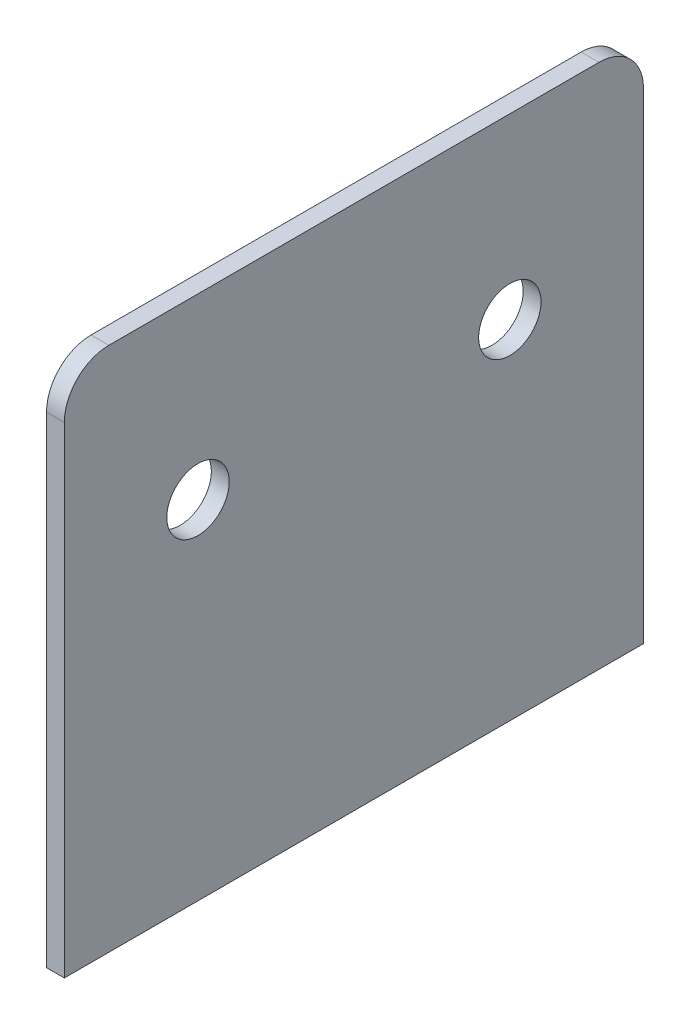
ISO-10303-21;
HEADER;
FILE_DESCRIPTION(('STEP AP214'),'2;1');
FILE_NAME('part.step','',(''),(''),'','','');
FILE_SCHEMA(('AUTOMOTIVE_DESIGN { 1 0 10303 214 1 1 1 1 }'));
ENDSEC;
DATA;
#1=APPLICATION_CONTEXT('core data for automotive mechanical design processes');
#2=APPLICATION_PROTOCOL_DEFINITION('international standard','automotive_design',2000,#1);
#3=PRODUCT_CONTEXT('',#1,'mechanical');
#4=PRODUCT('Part','Part','',(#3));
#5=PRODUCT_RELATED_PRODUCT_CATEGORY('part','',(#4));
#6=PRODUCT_DEFINITION_FORMATION('','',#4);
#7=PRODUCT_DEFINITION_CONTEXT('part definition',#1,'design');
#8=PRODUCT_DEFINITION('design','',#6,#7);
#9=PRODUCT_DEFINITION_SHAPE('','',#8);
#10=(LENGTH_UNIT() NAMED_UNIT(*) SI_UNIT(.MILLI.,.METRE.));
#11=(NAMED_UNIT(*) PLANE_ANGLE_UNIT() SI_UNIT($,.RADIAN.));
#12=(NAMED_UNIT(*) SI_UNIT($,.STERADIAN.) SOLID_ANGLE_UNIT());
#13=UNCERTAINTY_MEASURE_WITH_UNIT(LENGTH_MEASURE(1.E-05),#10,'distance_accuracy_value','');
#14=(GEOMETRIC_REPRESENTATION_CONTEXT(3) GLOBAL_UNCERTAINTY_ASSIGNED_CONTEXT((#13)) GLOBAL_UNIT_ASSIGNED_CONTEXT((#10,
#11,#12)) REPRESENTATION_CONTEXT('',''));
#15=CARTESIAN_POINT('',(0.,0.,0.));
#16=DIRECTION('',(0.,0.,1.));
#17=DIRECTION('',(1.,0.,0.));
#18=AXIS2_PLACEMENT_3D('',#15,#16,#17);
#19=CARTESIAN_POINT('',(2.,0.,32.5));
#20=DIRECTION('',(-1.,0.,0.));
#21=DIRECTION('',(0.,0.,1.));
#22=AXIS2_PLACEMENT_3D('',#19,#20,#21);
#23=PLANE('',#22);
#24=CARTESIAN_POINT('',(2.,39.,-17.5));
#25=DIRECTION('',(1.,0.,0.));
#26=DIRECTION('',(0.,0.,-1.));
#27=AXIS2_PLACEMENT_3D('',#24,#25,#26);
#28=CIRCLE('',#27,3.5);
#29=CARTESIAN_POINT('',(2.,39.,-21.));
#30=VERTEX_POINT('',#29);
#31=EDGE_CURVE('E133',#30,#30,#28,.T.);
#32=ORIENTED_EDGE('',*,*,#31,.F.);
#33=EDGE_LOOP('',(#32));
#34=FACE_BOUND('',#33,.T.);
#35=CARTESIAN_POINT('',(2.,39.,17.5));
#36=DIRECTION('',(1.,0.,0.));
#37=DIRECTION('',(0.,0.,-1.));
#38=AXIS2_PLACEMENT_3D('',#35,#36,#37);
#39=CIRCLE('',#38,3.5);
#40=CARTESIAN_POINT('',(2.,39.,14.));
#41=VERTEX_POINT('',#40);
#42=EDGE_CURVE('E129',#41,#41,#39,.T.);
#43=ORIENTED_EDGE('',*,*,#42,.F.);
#44=EDGE_LOOP('',(#43));
#45=FACE_BOUND('',#44,.T.);
#46=DIRECTION('',(0.,1.,0.));
#47=VECTOR('',#46,1.);
#48=CARTESIAN_POINT('',(2.,0.,-32.5));
#49=LINE('',#48,#47);
#50=CARTESIAN_POINT('',(2.,0.,-32.5));
#51=VERTEX_POINT('',#50);
#52=CARTESIAN_POINT('',(2.,54.,-32.5));
#53=VERTEX_POINT('',#52);
#54=EDGE_CURVE('E116',#51,#53,#49,.T.);
#55=ORIENTED_EDGE('',*,*,#54,.T.);
#56=CARTESIAN_POINT('',(2.,54.,-27.5));
#57=DIRECTION('',(-1.,0.,0.));
#58=DIRECTION('',(0.,0.,1.));
#59=AXIS2_PLACEMENT_3D('',#56,#57,#58);
#60=CIRCLE('',#59,5.);
#61=CARTESIAN_POINT('',(2.,59.,-27.5));
#62=VERTEX_POINT('',#61);
#63=EDGE_CURVE('E138',#53,#62,#60,.F.);
#64=ORIENTED_EDGE('',*,*,#63,.T.);
#65=DIRECTION('',(0.,0.,-1.));
#66=VECTOR('',#65,1.);
#67=CARTESIAN_POINT('',(2.,59.,32.5));
#68=LINE('',#67,#66);
#69=CARTESIAN_POINT('',(2.,59.,27.5));
#70=VERTEX_POINT('',#69);
#71=EDGE_CURVE('E124',#70,#62,#68,.T.);
#72=ORIENTED_EDGE('',*,*,#71,.F.);
#73=CARTESIAN_POINT('',(2.,54.,27.5));
#74=DIRECTION('',(-1.,0.,0.));
#75=DIRECTION('',(0.,0.,1.));
#76=AXIS2_PLACEMENT_3D('',#73,#74,#75);
#77=CIRCLE('',#76,5.);
#78=CARTESIAN_POINT('',(2.,54.,32.5));
#79=VERTEX_POINT('',#78);
#80=EDGE_CURVE('E136',#70,#79,#77,.F.);
#81=ORIENTED_EDGE('',*,*,#80,.T.);
#82=DIRECTION('',(0.,1.,0.));
#83=VECTOR('',#82,1.);
#84=CARTESIAN_POINT('',(2.,0.,32.5));
#85=LINE('',#84,#83);
#86=CARTESIAN_POINT('',(2.,0.,32.5));
#87=VERTEX_POINT('',#86);
#88=EDGE_CURVE('E108',#87,#79,#85,.T.);
#89=ORIENTED_EDGE('',*,*,#88,.F.);
#90=DIRECTION('',(0.,0.,-1.));
#91=VECTOR('',#90,1.);
#92=CARTESIAN_POINT('',(2.,0.,32.5));
#93=LINE('',#92,#91);
#94=EDGE_CURVE('E103',#87,#51,#93,.T.);
#95=ORIENTED_EDGE('',*,*,#94,.T.);
#96=EDGE_LOOP('',(#55,#64,#72,#81,#89,#95));
#97=FACE_BOUND('',#96,.T.);
#98=ADVANCED_FACE('F38',(#34,#45,#97),#23,.F.);
#99=CARTESIAN_POINT('',(0.,59.,32.5));
#100=DIRECTION('',(0.,1.,0.));
#101=DIRECTION('',(0.,0.,1.));
#102=AXIS2_PLACEMENT_3D('',#99,#100,#101);
#103=PLANE('',#102);
#104=ORIENTED_EDGE('',*,*,#71,.T.);
#105=DIRECTION('',(1.,0.,0.));
#106=VECTOR('',#105,1.);
#107=CARTESIAN_POINT('',(0.,59.,-27.5));
#108=LINE('',#107,#106);
#109=CARTESIAN_POINT('',(0.,59.,-27.5));
#110=VERTEX_POINT('',#109);
#111=EDGE_CURVE('E59',#62,#110,#108,.F.);
#112=ORIENTED_EDGE('',*,*,#111,.T.);
#113=DIRECTION('',(0.,0.,-1.));
#114=VECTOR('',#113,1.);
#115=CARTESIAN_POINT('',(0.,59.,32.5));
#116=LINE('',#115,#114);
#117=CARTESIAN_POINT('',(0.,59.,27.5));
#118=VERTEX_POINT('',#117);
#119=EDGE_CURVE('E102',#118,#110,#116,.T.);
#120=ORIENTED_EDGE('',*,*,#119,.F.);
#121=DIRECTION('',(1.,0.,0.));
#122=VECTOR('',#121,1.);
#123=CARTESIAN_POINT('',(2.,59.,27.5));
#124=LINE('',#123,#122);
#125=EDGE_CURVE('E140',#118,#70,#124,.T.);
#126=ORIENTED_EDGE('',*,*,#125,.T.);
#127=EDGE_LOOP('',(#104,#112,#120,#126));
#128=FACE_BOUND('',#127,.T.);
#129=ADVANCED_FACE('F154',(#128),#103,.T.);
#130=CARTESIAN_POINT('',(0.,0.,32.5));
#131=DIRECTION('',(-1.,0.,0.));
#132=DIRECTION('',(0.,0.,1.));
#133=AXIS2_PLACEMENT_3D('',#130,#131,#132);
#134=PLANE('',#133);
#135=CARTESIAN_POINT('',(0.,39.,-17.5));
#136=DIRECTION('',(-1.,0.,0.));
#137=DIRECTION('',(0.,0.,1.));
#138=AXIS2_PLACEMENT_3D('',#135,#136,#137);
#139=CIRCLE('',#138,3.5);
#140=CARTESIAN_POINT('',(0.,39.,-14.));
#141=VERTEX_POINT('',#140);
#142=EDGE_CURVE('E130',#141,#141,#139,.T.);
#143=ORIENTED_EDGE('',*,*,#142,.F.);
#144=EDGE_LOOP('',(#143));
#145=FACE_BOUND('',#144,.T.);
#146=CARTESIAN_POINT('',(0.,39.,17.5));
#147=DIRECTION('',(-1.,0.,0.));
#148=DIRECTION('',(0.,0.,1.));
#149=AXIS2_PLACEMENT_3D('',#146,#147,#148);
#150=CIRCLE('',#149,3.5);
#151=CARTESIAN_POINT('',(0.,39.,21.));
#152=VERTEX_POINT('',#151);
#153=EDGE_CURVE('E119',#152,#152,#150,.T.);
#154=ORIENTED_EDGE('',*,*,#153,.F.);
#155=EDGE_LOOP('',(#154));
#156=FACE_BOUND('',#155,.T.);
#157=ORIENTED_EDGE('',*,*,#119,.T.);
#158=CARTESIAN_POINT('',(0.,54.,-27.5));
#159=DIRECTION('',(-1.,0.,0.));
#160=DIRECTION('',(0.,0.,1.));
#161=AXIS2_PLACEMENT_3D('',#158,#159,#160);
#162=CIRCLE('',#161,5.);
#163=CARTESIAN_POINT('',(0.,54.,-32.5));
#164=VERTEX_POINT('',#163);
#165=EDGE_CURVE('E46',#110,#164,#162,.T.);
#166=ORIENTED_EDGE('',*,*,#165,.T.);
#167=DIRECTION('',(0.,1.,0.));
#168=VECTOR('',#167,1.);
#169=CARTESIAN_POINT('',(0.,0.,-32.5));
#170=LINE('',#169,#168);
#171=CARTESIAN_POINT('',(0.,0.,-32.5));
#172=VERTEX_POINT('',#171);
#173=EDGE_CURVE('E97',#172,#164,#170,.T.);
#174=ORIENTED_EDGE('',*,*,#173,.F.);
#175=DIRECTION('',(0.,0.,-1.));
#176=VECTOR('',#175,1.);
#177=CARTESIAN_POINT('',(0.,0.,32.5));
#178=LINE('',#177,#176);
#179=CARTESIAN_POINT('',(0.,0.,32.5));
#180=VERTEX_POINT('',#179);
#181=EDGE_CURVE('E92',#180,#172,#178,.T.);
#182=ORIENTED_EDGE('',*,*,#181,.F.);
#183=DIRECTION('',(0.,1.,0.));
#184=VECTOR('',#183,1.);
#185=CARTESIAN_POINT('',(0.,0.,32.5));
#186=LINE('',#185,#184);
#187=CARTESIAN_POINT('',(0.,54.,32.5));
#188=VERTEX_POINT('',#187);
#189=EDGE_CURVE('E94',#180,#188,#186,.T.);
#190=ORIENTED_EDGE('',*,*,#189,.T.);
#191=CARTESIAN_POINT('',(0.,54.,27.5));
#192=DIRECTION('',(-1.,0.,0.));
#193=DIRECTION('',(0.,0.,1.));
#194=AXIS2_PLACEMENT_3D('',#191,#192,#193);
#195=CIRCLE('',#194,5.);
#196=EDGE_CURVE('E144',#188,#118,#195,.T.);
#197=ORIENTED_EDGE('',*,*,#196,.T.);
#198=EDGE_LOOP('',(#157,#166,#174,#182,#190,#197));
#199=FACE_BOUND('',#198,.T.);
#200=ADVANCED_FACE('F93',(#145,#156,#199),#134,.T.);
#201=CARTESIAN_POINT('',(2.,0.,32.5));
#202=DIRECTION('',(0.,-1.,0.));
#203=DIRECTION('',(0.,0.,-1.));
#204=AXIS2_PLACEMENT_3D('',#201,#202,#203);
#205=PLANE('',#204);
#206=DIRECTION('',(-1.,0.,0.));
#207=VECTOR('',#206,1.);
#208=CARTESIAN_POINT('',(2.,0.,-32.5));
#209=LINE('',#208,#207);
#210=EDGE_CURVE('E121',#51,#172,#209,.T.);
#211=ORIENTED_EDGE('',*,*,#210,.F.);
#212=ORIENTED_EDGE('',*,*,#94,.F.);
#213=DIRECTION('',(-1.,0.,0.));
#214=VECTOR('',#213,1.);
#215=CARTESIAN_POINT('',(2.,0.,32.5));
#216=LINE('',#215,#214);
#217=EDGE_CURVE('E107',#87,#180,#216,.T.);
#218=ORIENTED_EDGE('',*,*,#217,.T.);
#219=ORIENTED_EDGE('',*,*,#181,.T.);
#220=EDGE_LOOP('',(#211,#212,#218,#219));
#221=FACE_BOUND('',#220,.T.);
#222=ADVANCED_FACE('F110',(#221),#205,.T.);
#223=CARTESIAN_POINT('',(0.,0.,32.5));
#224=DIRECTION('',(0.,0.,-1.));
#225=DIRECTION('',(-1.,0.,0.));
#226=AXIS2_PLACEMENT_3D('',#223,#224,#225);
#227=PLANE('',#226);
#228=ORIENTED_EDGE('',*,*,#88,.T.);
#229=DIRECTION('',(1.,0.,0.));
#230=VECTOR('',#229,1.);
#231=CARTESIAN_POINT('',(0.,54.,32.5));
#232=LINE('',#231,#230);
#233=EDGE_CURVE('E11',#79,#188,#232,.F.);
#234=ORIENTED_EDGE('',*,*,#233,.T.);
#235=ORIENTED_EDGE('',*,*,#189,.F.);
#236=ORIENTED_EDGE('',*,*,#217,.F.);
#237=EDGE_LOOP('',(#228,#234,#235,#236));
#238=FACE_BOUND('',#237,.T.);
#239=ADVANCED_FACE('F106',(#238),#227,.F.);
#240=CARTESIAN_POINT('',(0.,0.,-32.5));
#241=DIRECTION('',(0.,0.,-1.));
#242=DIRECTION('',(-1.,0.,0.));
#243=AXIS2_PLACEMENT_3D('',#240,#241,#242);
#244=PLANE('',#243);
#245=ORIENTED_EDGE('',*,*,#173,.T.);
#246=DIRECTION('',(1.,0.,0.));
#247=VECTOR('',#246,1.);
#248=CARTESIAN_POINT('',(0.,54.,-32.5));
#249=LINE('',#248,#247);
#250=EDGE_CURVE('E126',#164,#53,#249,.T.);
#251=ORIENTED_EDGE('',*,*,#250,.T.);
#252=ORIENTED_EDGE('',*,*,#54,.F.);
#253=ORIENTED_EDGE('',*,*,#210,.T.);
#254=EDGE_LOOP('',(#245,#251,#252,#253));
#255=FACE_BOUND('',#254,.T.);
#256=ADVANCED_FACE('F149',(#255),#244,.T.);
#257=CARTESIAN_POINT('',(-8.00000000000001,39.,17.5));
#258=DIRECTION('',(1.,0.,0.));
#259=DIRECTION('',(0.,0.,-1.));
#260=AXIS2_PLACEMENT_3D('',#257,#258,#259);
#261=CYLINDRICAL_SURFACE('',#260,3.5);
#262=ORIENTED_EDGE('',*,*,#153,.T.);
#263=EDGE_LOOP('',(#262));
#264=FACE_BOUND('',#263,.T.);
#265=ORIENTED_EDGE('',*,*,#42,.T.);
#266=EDGE_LOOP('',(#265));
#267=FACE_BOUND('',#266,.T.);
#268=ADVANCED_FACE('F170',(#264,#267),#261,.F.);
#269=CARTESIAN_POINT('',(-8.00000000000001,39.,-17.5));
#270=DIRECTION('',(1.,0.,0.));
#271=DIRECTION('',(0.,0.,-1.));
#272=AXIS2_PLACEMENT_3D('',#269,#270,#271);
#273=CYLINDRICAL_SURFACE('',#272,3.5);
#274=ORIENTED_EDGE('',*,*,#142,.T.);
#275=EDGE_LOOP('',(#274));
#276=FACE_BOUND('',#275,.T.);
#277=ORIENTED_EDGE('',*,*,#31,.T.);
#278=EDGE_LOOP('',(#277));
#279=FACE_BOUND('',#278,.T.);
#280=ADVANCED_FACE('F163',(#276,#279),#273,.F.);
#281=CARTESIAN_POINT('',(0.,54.,-27.5));
#282=DIRECTION('',(1.,0.,0.));
#283=DIRECTION('',(0.,0.,-1.));
#284=AXIS2_PLACEMENT_3D('',#281,#282,#283);
#285=CYLINDRICAL_SURFACE('',#284,5.);
#286=ORIENTED_EDGE('',*,*,#165,.F.);
#287=ORIENTED_EDGE('',*,*,#111,.F.);
#288=ORIENTED_EDGE('',*,*,#63,.F.);
#289=ORIENTED_EDGE('',*,*,#250,.F.);
#290=EDGE_LOOP('',(#286,#287,#288,#289));
#291=FACE_BOUND('',#290,.T.);
#292=ADVANCED_FACE('F151',(#291),#285,.T.);
#293=CARTESIAN_POINT('',(0.,54.,27.5));
#294=DIRECTION('',(-1.,0.,0.));
#295=DIRECTION('',(0.,0.,1.));
#296=AXIS2_PLACEMENT_3D('',#293,#294,#295);
#297=CYLINDRICAL_SURFACE('',#296,5.);
#298=ORIENTED_EDGE('',*,*,#196,.F.);
#299=ORIENTED_EDGE('',*,*,#233,.F.);
#300=ORIENTED_EDGE('',*,*,#80,.F.);
#301=ORIENTED_EDGE('',*,*,#125,.F.);
#302=EDGE_LOOP('',(#298,#299,#300,#301));
#303=FACE_BOUND('',#302,.T.);
#304=ADVANCED_FACE('F40',(#303),#297,.T.);
#305=CLOSED_SHELL('',(#98,#129,#200,#222,#239,#256,#268,#280,#292,#304));
#306=MANIFOLD_SOLID_BREP('B2',#305);
#307=ADVANCED_BREP_SHAPE_REPRESENTATION('',(#18,#306),#14);
#308=SHAPE_DEFINITION_REPRESENTATION(#9,#307);
ENDSEC;
END-ISO-10303-21;
